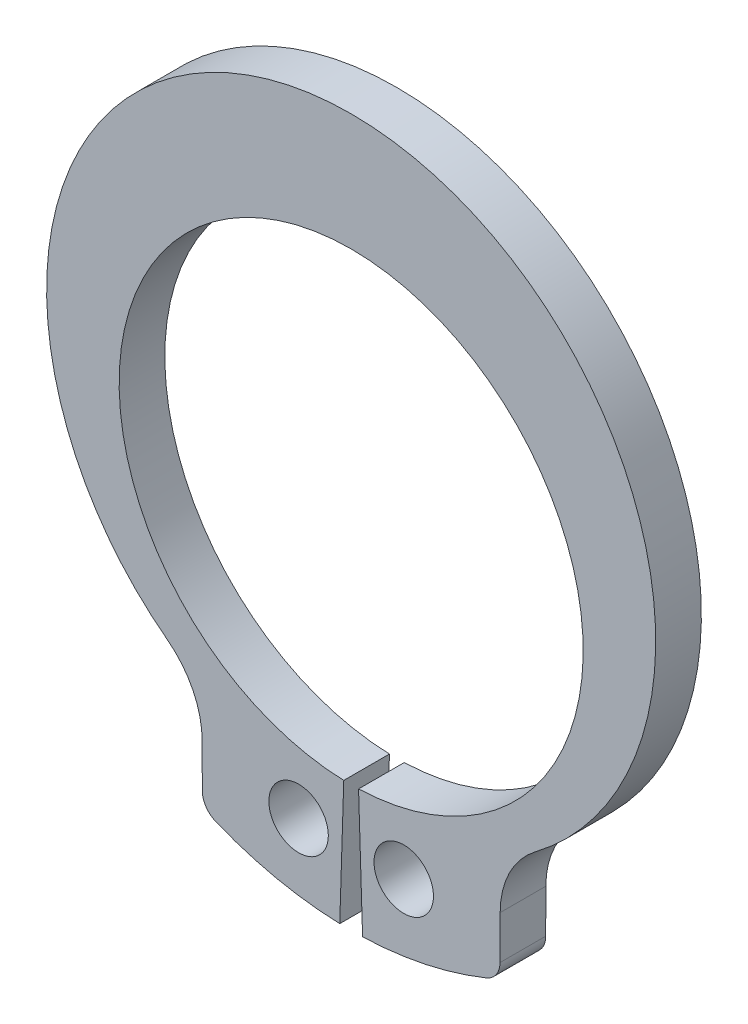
ISO-10303-21;
HEADER;
FILE_DESCRIPTION(('STEP AP214'),'2;1');
FILE_NAME('part.step','',(''),(''),'','','');
FILE_SCHEMA(('AUTOMOTIVE_DESIGN { 1 0 10303 214 1 1 1 1 }'));
ENDSEC;
DATA;
#1=APPLICATION_CONTEXT('core data for automotive mechanical design processes');
#2=APPLICATION_PROTOCOL_DEFINITION('international standard','automotive_design',2000,#1);
#3=PRODUCT_CONTEXT('',#1,'mechanical');
#4=PRODUCT('Part','Part','',(#3));
#5=PRODUCT_RELATED_PRODUCT_CATEGORY('part','',(#4));
#6=PRODUCT_DEFINITION_FORMATION('','',#4);
#7=PRODUCT_DEFINITION_CONTEXT('part definition',#1,'design');
#8=PRODUCT_DEFINITION('design','',#6,#7);
#9=PRODUCT_DEFINITION_SHAPE('','',#8);
#10=(LENGTH_UNIT() NAMED_UNIT(*) SI_UNIT(.MILLI.,.METRE.));
#11=(NAMED_UNIT(*) PLANE_ANGLE_UNIT() SI_UNIT($,.RADIAN.));
#12=(NAMED_UNIT(*) SI_UNIT($,.STERADIAN.) SOLID_ANGLE_UNIT());
#13=UNCERTAINTY_MEASURE_WITH_UNIT(LENGTH_MEASURE(1.E-05),#10,'distance_accuracy_value','');
#14=(GEOMETRIC_REPRESENTATION_CONTEXT(3) GLOBAL_UNCERTAINTY_ASSIGNED_CONTEXT((#13)) GLOBAL_UNIT_ASSIGNED_CONTEXT((#10,
#11,#12)) REPRESENTATION_CONTEXT('',''));
#15=CARTESIAN_POINT('',(0.,0.,0.));
#16=DIRECTION('',(0.,0.,1.));
#17=DIRECTION('',(1.,0.,0.));
#18=AXIS2_PLACEMENT_3D('',#15,#16,#17);
#19=CARTESIAN_POINT('',(0.,0.,-0.799999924));
#20=DIRECTION('',(0.,0.,1.));
#21=DIRECTION('',(1.,0.,0.));
#22=AXIS2_PLACEMENT_3D('',#19,#20,#21);
#23=CYLINDRICAL_SURFACE('',#22,4.064);
#24=CARTESIAN_POINT('',(0.,0.,0.));
#25=DIRECTION('',(0.,0.,-1.));
#26=DIRECTION('',(1.,0.,0.));
#27=AXIS2_PLACEMENT_3D('',#24,#25,#26);
#28=CIRCLE('',#27,4.064);
#29=CARTESIAN_POINT('',(-0.129554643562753,-4.06193446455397,0.));
#30=VERTEX_POINT('',#29);
#31=CARTESIAN_POINT('',(0.129554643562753,-4.06193446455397,0.));
#32=VERTEX_POINT('',#31);
#33=EDGE_CURVE('E153',#30,#32,#28,.T.);
#34=ORIENTED_EDGE('',*,*,#33,.F.);
#35=DIRECTION('',(0.,0.,1.));
#36=VECTOR('',#35,1.);
#37=CARTESIAN_POINT('',(-0.129554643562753,-4.06193446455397,-0.799999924));
#38=LINE('',#37,#36);
#39=CARTESIAN_POINT('',(-0.129554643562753,-4.06193446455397,-0.799999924));
#40=VERTEX_POINT('',#39);
#41=EDGE_CURVE('E11',#40,#30,#38,.T.);
#42=ORIENTED_EDGE('',*,*,#41,.F.);
#43=CARTESIAN_POINT('',(0.,0.,-0.799999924));
#44=DIRECTION('',(0.,0.,-1.));
#45=DIRECTION('',(1.,0.,0.));
#46=AXIS2_PLACEMENT_3D('',#43,#44,#45);
#47=CIRCLE('',#46,4.064);
#48=CARTESIAN_POINT('',(0.129554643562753,-4.06193446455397,-0.799999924));
#49=VERTEX_POINT('',#48);
#50=EDGE_CURVE('E186',#40,#49,#47,.T.);
#51=ORIENTED_EDGE('',*,*,#50,.T.);
#52=DIRECTION('',(0.,0.,1.));
#53=VECTOR('',#52,1.);
#54=CARTESIAN_POINT('',(0.129554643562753,-4.06193446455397,-0.799999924));
#55=LINE('',#54,#53);
#56=EDGE_CURVE('E35',#49,#32,#55,.T.);
#57=ORIENTED_EDGE('',*,*,#56,.T.);
#58=EDGE_LOOP('',(#34,#42,#51,#57));
#59=FACE_BOUND('',#58,.T.);
#60=ADVANCED_FACE('F32',(#59),#23,.F.);
#61=CARTESIAN_POINT('',(-0.129554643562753,-4.06193446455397,-0.799999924));
#62=DIRECTION('',(0.999491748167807,-0.0318786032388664,0.));
#63=DIRECTION('',(0.0318786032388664,0.999491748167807,0.));
#64=AXIS2_PLACEMENT_3D('',#61,#62,#63);
#65=PLANE('',#64);
#66=DIRECTION('',(0.0318786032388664,0.999491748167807,0.));
#67=VECTOR('',#66,1.);
#68=CARTESIAN_POINT('',(-0.129554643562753,-4.06193446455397,0.));
#69=LINE('',#68,#67);
#70=CARTESIAN_POINT('',(-0.199999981,-6.27061132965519,0.));
#71=VERTEX_POINT('',#70);
#72=EDGE_CURVE('E184',#71,#30,#69,.T.);
#73=ORIENTED_EDGE('',*,*,#72,.F.);
#74=DIRECTION('',(0.,0.,1.));
#75=VECTOR('',#74,1.);
#76=CARTESIAN_POINT('',(-0.199999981,-6.27061132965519,-0.799999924));
#77=LINE('',#76,#75);
#78=CARTESIAN_POINT('',(-0.199999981,-6.27061132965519,-0.799999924));
#79=VERTEX_POINT('',#78);
#80=EDGE_CURVE('E41',#79,#71,#77,.T.);
#81=ORIENTED_EDGE('',*,*,#80,.F.);
#82=DIRECTION('',(0.0318786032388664,0.999491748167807,0.));
#83=VECTOR('',#82,1.);
#84=CARTESIAN_POINT('',(-0.129554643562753,-4.06193446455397,-0.799999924));
#85=LINE('',#84,#83);
#86=EDGE_CURVE('E143',#79,#40,#85,.T.);
#87=ORIENTED_EDGE('',*,*,#86,.T.);
#88=ORIENTED_EDGE('',*,*,#41,.T.);
#89=EDGE_LOOP('',(#73,#81,#87,#88));
#90=FACE_BOUND('',#89,.T.);
#91=ADVANCED_FACE('F206',(#90),#65,.T.);
#92=CARTESIAN_POINT('',(0.,0.,-0.799999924));
#93=DIRECTION('',(0.,0.,1.));
#94=DIRECTION('',(1.,0.,0.));
#95=AXIS2_PLACEMENT_3D('',#92,#93,#94);
#96=CYLINDRICAL_SURFACE('',#95,6.2738);
#97=CARTESIAN_POINT('',(0.,0.,0.));
#98=DIRECTION('',(0.,0.,1.));
#99=DIRECTION('',(1.,0.,0.));
#100=AXIS2_PLACEMENT_3D('',#97,#98,#99);
#101=CIRCLE('',#100,6.2738);
#102=CARTESIAN_POINT('',(-2.37042236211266,-5.80875754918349,0.));
#103=VERTEX_POINT('',#102);
#104=EDGE_CURVE('E130',#103,#71,#101,.T.);
#105=ORIENTED_EDGE('',*,*,#104,.F.);
#106=DIRECTION('',(0.,0.,1.));
#107=VECTOR('',#106,1.);
#108=CARTESIAN_POINT('',(-2.37042236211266,-5.80875754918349,-0.799999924));
#109=LINE('',#108,#107);
#110=CARTESIAN_POINT('',(-2.37042236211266,-5.80875754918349,-0.799999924));
#111=VERTEX_POINT('',#110);
#112=EDGE_CURVE('E125',#111,#103,#109,.T.);
#113=ORIENTED_EDGE('',*,*,#112,.F.);
#114=CARTESIAN_POINT('',(0.,0.,-0.799999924));
#115=DIRECTION('',(0.,0.,1.));
#116=DIRECTION('',(1.,0.,0.));
#117=AXIS2_PLACEMENT_3D('',#114,#115,#116);
#118=CIRCLE('',#117,6.2738);
#119=EDGE_CURVE('E128',#111,#79,#118,.T.);
#120=ORIENTED_EDGE('',*,*,#119,.T.);
#121=ORIENTED_EDGE('',*,*,#80,.T.);
#122=EDGE_LOOP('',(#105,#113,#120,#121));
#123=FACE_BOUND('',#122,.T.);
#124=ADVANCED_FACE('F127',(#123),#96,.T.);
#125=CARTESIAN_POINT('',(-2.22646958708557,-5.45599899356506,-0.799999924));
#126=DIRECTION('',(0.,0.,1.));
#127=DIRECTION('',(1.,0.,0.));
#128=AXIS2_PLACEMENT_3D('',#125,#126,#127);
#129=CYLINDRICAL_SURFACE('',#128,0.381);
#130=CARTESIAN_POINT('',(-2.22646958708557,-5.45599899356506,0.));
#131=DIRECTION('',(0.,0.,1.));
#132=DIRECTION('',(1.,0.,0.));
#133=AXIS2_PLACEMENT_3D('',#130,#131,#132);
#134=CIRCLE('',#133,0.381);
#135=CARTESIAN_POINT('',(-2.60746810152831,-5.45706294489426,0.));
#136=VERTEX_POINT('',#135);
#137=EDGE_CURVE('E181',#136,#103,#134,.T.);
#138=ORIENTED_EDGE('',*,*,#137,.F.);
#139=DIRECTION('',(0.,0.,1.));
#140=VECTOR('',#139,1.);
#141=CARTESIAN_POINT('',(-2.60746810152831,-5.45706294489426,-0.799999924));
#142=LINE('',#141,#140);
#143=CARTESIAN_POINT('',(-2.60746810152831,-5.45706294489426,-0.799999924));
#144=VERTEX_POINT('',#143);
#145=EDGE_CURVE('E135',#144,#136,#142,.T.);
#146=ORIENTED_EDGE('',*,*,#145,.F.);
#147=CARTESIAN_POINT('',(-2.22646958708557,-5.45599899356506,-0.799999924));
#148=DIRECTION('',(0.,0.,1.));
#149=DIRECTION('',(1.,0.,0.));
#150=AXIS2_PLACEMENT_3D('',#147,#148,#149);
#151=CIRCLE('',#150,0.381);
#152=EDGE_CURVE('E141',#144,#111,#151,.T.);
#153=ORIENTED_EDGE('',*,*,#152,.T.);
#154=ORIENTED_EDGE('',*,*,#112,.T.);
#155=EDGE_LOOP('',(#138,#146,#153,#154));
#156=FACE_BOUND('',#155,.T.);
#157=ADVANCED_FACE('F145',(#156),#129,.T.);
#158=CARTESIAN_POINT('',(-2.60958822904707,-4.69785017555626,-0.799999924));
#159=DIRECTION('',(-0.99999610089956,-0.00279252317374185,0.));
#160=DIRECTION('',(0.00279252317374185,-0.999996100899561,0.));
#161=AXIS2_PLACEMENT_3D('',#158,#159,#160);
#162=PLANE('',#161);
#163=DIRECTION('',(0.00279252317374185,-0.99999610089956,0.));
#164=VECTOR('',#163,1.);
#165=CARTESIAN_POINT('',(-2.60958822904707,-4.69785017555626,0.));
#166=LINE('',#165,#164);
#167=CARTESIAN_POINT('',(-2.60958822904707,-4.69785017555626,0.));
#168=VERTEX_POINT('',#167);
#169=EDGE_CURVE('E178',#168,#136,#166,.T.);
#170=ORIENTED_EDGE('',*,*,#169,.F.);
#171=DIRECTION('',(0.,0.,1.));
#172=VECTOR('',#171,1.);
#173=CARTESIAN_POINT('',(-2.60958822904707,-4.69785017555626,-0.799999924));
#174=LINE('',#173,#172);
#175=CARTESIAN_POINT('',(-2.60958822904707,-4.69785017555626,-0.799999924));
#176=VERTEX_POINT('',#175);
#177=EDGE_CURVE('E190',#176,#168,#174,.T.);
#178=ORIENTED_EDGE('',*,*,#177,.F.);
#179=DIRECTION('',(0.00279252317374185,-0.99999610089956,0.));
#180=VECTOR('',#179,1.);
#181=CARTESIAN_POINT('',(-2.60958822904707,-4.69785017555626,-0.799999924));
#182=LINE('',#181,#180);
#183=EDGE_CURVE('E146',#176,#144,#182,.T.);
#184=ORIENTED_EDGE('',*,*,#183,.T.);
#185=ORIENTED_EDGE('',*,*,#145,.T.);
#186=EDGE_LOOP('',(#170,#178,#184,#185));
#187=FACE_BOUND('',#186,.T.);
#188=ADVANCED_FACE('F219',(#187),#162,.T.);
#189=CARTESIAN_POINT('',(-4.15334165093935,-4.7021611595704,-0.799999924));
#190=DIRECTION('',(0.,0.,1.));
#191=DIRECTION('',(1.,0.,0.));
#192=AXIS2_PLACEMENT_3D('',#189,#190,#191);
#193=CYLINDRICAL_SURFACE('',#192,1.54375944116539);
#194=CARTESIAN_POINT('',(-4.15334165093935,-4.7021611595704,0.));
#195=DIRECTION('',(0.,0.,-1.));
#196=DIRECTION('',(1.,0.,0.));
#197=AXIS2_PLACEMENT_3D('',#194,#195,#196);
#198=CIRCLE('',#197,1.54375944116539);
#199=CARTESIAN_POINT('',(-3.2210961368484,-3.47166877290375,0.));
#200=VERTEX_POINT('',#199);
#201=EDGE_CURVE('E175',#200,#168,#198,.T.);
#202=ORIENTED_EDGE('',*,*,#201,.F.);
#203=DIRECTION('',(0.,0.,1.));
#204=VECTOR('',#203,1.);
#205=CARTESIAN_POINT('',(-3.2210961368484,-3.47166877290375,-0.799999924));
#206=LINE('',#205,#204);
#207=CARTESIAN_POINT('',(-3.2210961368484,-3.47166877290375,-0.799999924));
#208=VERTEX_POINT('',#207);
#209=EDGE_CURVE('E192',#208,#200,#206,.T.);
#210=ORIENTED_EDGE('',*,*,#209,.F.);
#211=CARTESIAN_POINT('',(-4.15334165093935,-4.7021611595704,-0.799999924));
#212=DIRECTION('',(0.,0.,-1.));
#213=DIRECTION('',(1.,0.,0.));
#214=AXIS2_PLACEMENT_3D('',#211,#212,#213);
#215=CIRCLE('',#214,1.54375944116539);
#216=EDGE_CURVE('E148',#208,#176,#215,.T.);
#217=ORIENTED_EDGE('',*,*,#216,.T.);
#218=ORIENTED_EDGE('',*,*,#177,.T.);
#219=EDGE_LOOP('',(#202,#210,#217,#218));
#220=FACE_BOUND('',#219,.T.);
#221=ADVANCED_FACE('F222',(#220),#193,.F.);
#222=CARTESIAN_POINT('',(0.,0.77993041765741,-0.799999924));
#223=DIRECTION('',(0.,0.,1.));
#224=DIRECTION('',(1.,0.,0.));
#225=AXIS2_PLACEMENT_3D('',#222,#223,#224);
#226=CYLINDRICAL_SURFACE('',#225,5.334);
#227=CARTESIAN_POINT('',(0.,0.77993041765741,0.));
#228=DIRECTION('',(0.,0.,1.));
#229=DIRECTION('',(1.,0.,0.));
#230=AXIS2_PLACEMENT_3D('',#227,#228,#229);
#231=CIRCLE('',#230,5.334);
#232=CARTESIAN_POINT('',(3.2210961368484,-3.47166877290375,0.));
#233=VERTEX_POINT('',#232);
#234=EDGE_CURVE('E172',#233,#200,#231,.T.);
#235=ORIENTED_EDGE('',*,*,#234,.F.);
#236=DIRECTION('',(0.,0.,1.));
#237=VECTOR('',#236,1.);
#238=CARTESIAN_POINT('',(3.2210961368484,-3.47166877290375,-0.799999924));
#239=LINE('',#238,#237);
#240=CARTESIAN_POINT('',(3.2210961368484,-3.47166877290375,-0.799999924));
#241=VERTEX_POINT('',#240);
#242=EDGE_CURVE('E194',#241,#233,#239,.T.);
#243=ORIENTED_EDGE('',*,*,#242,.F.);
#244=CARTESIAN_POINT('',(0.,0.77993041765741,-0.799999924));
#245=DIRECTION('',(0.,0.,1.));
#246=DIRECTION('',(1.,0.,0.));
#247=AXIS2_PLACEMENT_3D('',#244,#245,#246);
#248=CIRCLE('',#247,5.334);
#249=EDGE_CURVE('E296',#241,#208,#248,.T.);
#250=ORIENTED_EDGE('',*,*,#249,.T.);
#251=ORIENTED_EDGE('',*,*,#209,.T.);
#252=EDGE_LOOP('',(#235,#243,#250,#251));
#253=FACE_BOUND('',#252,.T.);
#254=ADVANCED_FACE('F226',(#253),#226,.T.);
#255=CARTESIAN_POINT('',(4.15334165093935,-4.7021611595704,-0.799999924));
#256=DIRECTION('',(0.,0.,1.));
#257=DIRECTION('',(1.,0.,0.));
#258=AXIS2_PLACEMENT_3D('',#255,#256,#257);
#259=CYLINDRICAL_SURFACE('',#258,1.54375944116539);
#260=CARTESIAN_POINT('',(4.15334165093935,-4.7021611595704,0.));
#261=DIRECTION('',(0.,0.,-1.));
#262=DIRECTION('',(1.,0.,0.));
#263=AXIS2_PLACEMENT_3D('',#260,#261,#262);
#264=CIRCLE('',#263,1.54375944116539);
#265=CARTESIAN_POINT('',(2.60958822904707,-4.69785017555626,0.));
#266=VERTEX_POINT('',#265);
#267=EDGE_CURVE('E169',#266,#233,#264,.T.);
#268=ORIENTED_EDGE('',*,*,#267,.F.);
#269=DIRECTION('',(0.,0.,1.));
#270=VECTOR('',#269,1.);
#271=CARTESIAN_POINT('',(2.60958822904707,-4.69785017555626,-0.799999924));
#272=LINE('',#271,#270);
#273=CARTESIAN_POINT('',(2.60958822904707,-4.69785017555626,-0.799999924));
#274=VERTEX_POINT('',#273);
#275=EDGE_CURVE('E196',#274,#266,#272,.T.);
#276=ORIENTED_EDGE('',*,*,#275,.F.);
#277=CARTESIAN_POINT('',(4.15334165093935,-4.7021611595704,-0.799999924));
#278=DIRECTION('',(0.,0.,-1.));
#279=DIRECTION('',(1.,0.,0.));
#280=AXIS2_PLACEMENT_3D('',#277,#278,#279);
#281=CIRCLE('',#280,1.54375944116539);
#282=EDGE_CURVE('E293',#274,#241,#281,.T.);
#283=ORIENTED_EDGE('',*,*,#282,.T.);
#284=ORIENTED_EDGE('',*,*,#242,.T.);
#285=EDGE_LOOP('',(#268,#276,#283,#284));
#286=FACE_BOUND('',#285,.T.);
#287=ADVANCED_FACE('F230',(#286),#259,.F.);
#288=CARTESIAN_POINT('',(2.60958822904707,-4.69785017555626,-0.799999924));
#289=DIRECTION('',(0.99999610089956,-0.00279252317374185,0.));
#290=DIRECTION('',(0.00279252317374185,0.999996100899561,0.));
#291=AXIS2_PLACEMENT_3D('',#288,#289,#290);
#292=PLANE('',#291);
#293=DIRECTION('',(0.00279252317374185,0.99999610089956,0.));
#294=VECTOR('',#293,1.);
#295=CARTESIAN_POINT('',(2.60958822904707,-4.69785017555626,0.));
#296=LINE('',#295,#294);
#297=CARTESIAN_POINT('',(2.60746810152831,-5.45706294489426,0.));
#298=VERTEX_POINT('',#297);
#299=EDGE_CURVE('E166',#298,#266,#296,.T.);
#300=ORIENTED_EDGE('',*,*,#299,.F.);
#301=DIRECTION('',(0.,0.,1.));
#302=VECTOR('',#301,1.);
#303=CARTESIAN_POINT('',(2.60746810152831,-5.45706294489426,-0.799999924));
#304=LINE('',#303,#302);
#305=CARTESIAN_POINT('',(2.60746810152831,-5.45706294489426,-0.799999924));
#306=VERTEX_POINT('',#305);
#307=EDGE_CURVE('E198',#306,#298,#304,.T.);
#308=ORIENTED_EDGE('',*,*,#307,.F.);
#309=DIRECTION('',(0.00279252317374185,0.99999610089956,0.));
#310=VECTOR('',#309,1.);
#311=CARTESIAN_POINT('',(2.60958822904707,-4.69785017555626,-0.799999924));
#312=LINE('',#311,#310);
#313=EDGE_CURVE('E290',#306,#274,#312,.T.);
#314=ORIENTED_EDGE('',*,*,#313,.T.);
#315=ORIENTED_EDGE('',*,*,#275,.T.);
#316=EDGE_LOOP('',(#300,#308,#314,#315));
#317=FACE_BOUND('',#316,.T.);
#318=ADVANCED_FACE('F234',(#317),#292,.T.);
#319=CARTESIAN_POINT('',(2.22646958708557,-5.45599899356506,-0.799999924));
#320=DIRECTION('',(0.,0.,1.));
#321=DIRECTION('',(1.,0.,0.));
#322=AXIS2_PLACEMENT_3D('',#319,#320,#321);
#323=CYLINDRICAL_SURFACE('',#322,0.381);
#324=CARTESIAN_POINT('',(2.22646958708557,-5.45599899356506,0.));
#325=DIRECTION('',(0.,0.,1.));
#326=DIRECTION('',(-1.,0.,0.));
#327=AXIS2_PLACEMENT_3D('',#324,#325,#326);
#328=CIRCLE('',#327,0.381);
#329=CARTESIAN_POINT('',(2.37042236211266,-5.8087575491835,0.));
#330=VERTEX_POINT('',#329);
#331=EDGE_CURVE('E163',#330,#298,#328,.T.);
#332=ORIENTED_EDGE('',*,*,#331,.F.);
#333=DIRECTION('',(0.,0.,1.));
#334=VECTOR('',#333,1.);
#335=CARTESIAN_POINT('',(2.37042236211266,-5.8087575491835,-0.799999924));
#336=LINE('',#335,#334);
#337=CARTESIAN_POINT('',(2.37042236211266,-5.8087575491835,-0.799999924));
#338=VERTEX_POINT('',#337);
#339=EDGE_CURVE('E200',#338,#330,#336,.T.);
#340=ORIENTED_EDGE('',*,*,#339,.F.);
#341=CARTESIAN_POINT('',(2.22646958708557,-5.45599899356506,-0.799999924));
#342=DIRECTION('',(0.,0.,1.));
#343=DIRECTION('',(-1.,0.,0.));
#344=AXIS2_PLACEMENT_3D('',#341,#342,#343);
#345=CIRCLE('',#344,0.381);
#346=EDGE_CURVE('E287',#338,#306,#345,.T.);
#347=ORIENTED_EDGE('',*,*,#346,.T.);
#348=ORIENTED_EDGE('',*,*,#307,.T.);
#349=EDGE_LOOP('',(#332,#340,#347,#348));
#350=FACE_BOUND('',#349,.T.);
#351=ADVANCED_FACE('F238',(#350),#323,.T.);
#352=CARTESIAN_POINT('',(0.,0.,-0.799999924));
#353=DIRECTION('',(0.,0.,1.));
#354=DIRECTION('',(1.,0.,0.));
#355=AXIS2_PLACEMENT_3D('',#352,#353,#354);
#356=CYLINDRICAL_SURFACE('',#355,6.2738);
#357=CARTESIAN_POINT('',(0.,0.,0.));
#358=DIRECTION('',(0.,0.,1.));
#359=DIRECTION('',(1.,0.,0.));
#360=AXIS2_PLACEMENT_3D('',#357,#358,#359);
#361=CIRCLE('',#360,6.2738);
#362=CARTESIAN_POINT('',(0.199999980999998,-6.27061132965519,0.));
#363=VERTEX_POINT('',#362);
#364=EDGE_CURVE('E160',#363,#330,#361,.T.);
#365=ORIENTED_EDGE('',*,*,#364,.F.);
#366=DIRECTION('',(0.,0.,1.));
#367=VECTOR('',#366,1.);
#368=CARTESIAN_POINT('',(0.199999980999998,-6.27061132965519,-0.799999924));
#369=LINE('',#368,#367);
#370=CARTESIAN_POINT('',(0.199999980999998,-6.27061132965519,-0.799999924));
#371=VERTEX_POINT('',#370);
#372=EDGE_CURVE('E201',#371,#363,#369,.T.);
#373=ORIENTED_EDGE('',*,*,#372,.F.);
#374=CARTESIAN_POINT('',(0.,0.,-0.799999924));
#375=DIRECTION('',(0.,0.,1.));
#376=DIRECTION('',(1.,0.,0.));
#377=AXIS2_PLACEMENT_3D('',#374,#375,#376);
#378=CIRCLE('',#377,6.2738);
#379=EDGE_CURVE('E284',#371,#338,#378,.T.);
#380=ORIENTED_EDGE('',*,*,#379,.T.);
#381=ORIENTED_EDGE('',*,*,#339,.T.);
#382=EDGE_LOOP('',(#365,#373,#380,#381));
#383=FACE_BOUND('',#382,.T.);
#384=ADVANCED_FACE('F242',(#383),#356,.T.);
#385=CARTESIAN_POINT('',(0.129554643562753,-4.06193446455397,-0.799999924));
#386=DIRECTION('',(-0.999491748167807,-0.0318786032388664,0.));
#387=DIRECTION('',(0.0318786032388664,-0.999491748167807,0.));
#388=AXIS2_PLACEMENT_3D('',#385,#386,#387);
#389=PLANE('',#388);
#390=DIRECTION('',(0.0318786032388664,-0.999491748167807,0.));
#391=VECTOR('',#390,1.);
#392=CARTESIAN_POINT('',(0.129554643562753,-4.06193446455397,0.));
#393=LINE('',#392,#391);
#394=EDGE_CURVE('E156',#32,#363,#393,.T.);
#395=ORIENTED_EDGE('',*,*,#394,.F.);
#396=ORIENTED_EDGE('',*,*,#56,.F.);
#397=DIRECTION('',(0.0318786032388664,-0.999491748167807,0.));
#398=VECTOR('',#397,1.);
#399=CARTESIAN_POINT('',(0.129554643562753,-4.06193446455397,-0.799999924));
#400=LINE('',#399,#398);
#401=EDGE_CURVE('E282',#49,#371,#400,.T.);
#402=ORIENTED_EDGE('',*,*,#401,.T.);
#403=ORIENTED_EDGE('',*,*,#372,.T.);
#404=EDGE_LOOP('',(#395,#396,#402,#403));
#405=FACE_BOUND('',#404,.T.);
#406=ADVANCED_FACE('F203',(#405),#389,.T.);
#407=CARTESIAN_POINT('',(0.,0.,-0.799999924));
#408=DIRECTION('',(0.,0.,1.));
#409=DIRECTION('',(1.,0.,0.));
#410=AXIS2_PLACEMENT_3D('',#407,#408,#409);
#411=PLANE('',#410);
#412=CARTESIAN_POINT('',(-0.920699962,-5.03460616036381,-0.799999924));
#413=DIRECTION('',(0.,0.,1.));
#414=DIRECTION('',(1.,0.,0.));
#415=AXIS2_PLACEMENT_3D('',#412,#413,#414);
#416=CIRCLE('',#415,0.5207);
#417=CARTESIAN_POINT('',(-0.399999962,-5.03460616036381,-0.799999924));
#418=VERTEX_POINT('',#417);
#419=EDGE_CURVE('E269',#418,#418,#416,.T.);
#420=ORIENTED_EDGE('',*,*,#419,.T.);
#421=EDGE_LOOP('',(#420));
#422=FACE_BOUND('',#421,.T.);
#423=CARTESIAN_POINT('',(0.920699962,-5.03460616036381,-0.799999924));
#424=DIRECTION('',(0.,0.,1.));
#425=DIRECTION('',(1.,0.,0.));
#426=AXIS2_PLACEMENT_3D('',#423,#424,#425);
#427=CIRCLE('',#426,0.5207);
#428=CARTESIAN_POINT('',(1.441399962,-5.03460616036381,-0.799999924));
#429=VERTEX_POINT('',#428);
#430=EDGE_CURVE('E157',#429,#429,#427,.T.);
#431=ORIENTED_EDGE('',*,*,#430,.T.);
#432=EDGE_LOOP('',(#431));
#433=FACE_BOUND('',#432,.T.);
#434=ORIENTED_EDGE('',*,*,#50,.F.);
#435=ORIENTED_EDGE('',*,*,#86,.F.);
#436=ORIENTED_EDGE('',*,*,#119,.F.);
#437=ORIENTED_EDGE('',*,*,#152,.F.);
#438=ORIENTED_EDGE('',*,*,#183,.F.);
#439=ORIENTED_EDGE('',*,*,#216,.F.);
#440=ORIENTED_EDGE('',*,*,#249,.F.);
#441=ORIENTED_EDGE('',*,*,#282,.F.);
#442=ORIENTED_EDGE('',*,*,#313,.F.);
#443=ORIENTED_EDGE('',*,*,#346,.F.);
#444=ORIENTED_EDGE('',*,*,#379,.F.);
#445=ORIENTED_EDGE('',*,*,#401,.F.);
#446=EDGE_LOOP('',(#434,#435,#436,#437,#438,#439,#440,#441,#442,#443,#444,#445));
#447=FACE_BOUND('',#446,.T.);
#448=ADVANCED_FACE('F139',(#422,#433,#447),#411,.F.);
#449=CARTESIAN_POINT('',(0.,0.,0.));
#450=DIRECTION('',(0.,0.,1.));
#451=DIRECTION('',(1.,0.,0.));
#452=AXIS2_PLACEMENT_3D('',#449,#450,#451);
#453=PLANE('',#452);
#454=CARTESIAN_POINT('',(-0.920699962,-5.03460616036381,0.));
#455=DIRECTION('',(0.,0.,1.));
#456=DIRECTION('',(1.,0.,0.));
#457=AXIS2_PLACEMENT_3D('',#454,#455,#456);
#458=CIRCLE('',#457,0.5207);
#459=CARTESIAN_POINT('',(-0.399999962,-5.03460616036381,0.));
#460=VERTEX_POINT('',#459);
#461=EDGE_CURVE('E272',#460,#460,#458,.T.);
#462=ORIENTED_EDGE('',*,*,#461,.F.);
#463=EDGE_LOOP('',(#462));
#464=FACE_BOUND('',#463,.T.);
#465=CARTESIAN_POINT('',(0.920699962,-5.03460616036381,0.));
#466=DIRECTION('',(0.,0.,1.));
#467=DIRECTION('',(1.,0.,0.));
#468=AXIS2_PLACEMENT_3D('',#465,#466,#467);
#469=CIRCLE('',#468,0.5207);
#470=CARTESIAN_POINT('',(1.441399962,-5.03460616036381,0.));
#471=VERTEX_POINT('',#470);
#472=EDGE_CURVE('E274',#471,#471,#469,.T.);
#473=ORIENTED_EDGE('',*,*,#472,.F.);
#474=EDGE_LOOP('',(#473));
#475=FACE_BOUND('',#474,.T.);
#476=ORIENTED_EDGE('',*,*,#33,.T.);
#477=ORIENTED_EDGE('',*,*,#394,.T.);
#478=ORIENTED_EDGE('',*,*,#364,.T.);
#479=ORIENTED_EDGE('',*,*,#331,.T.);
#480=ORIENTED_EDGE('',*,*,#299,.T.);
#481=ORIENTED_EDGE('',*,*,#267,.T.);
#482=ORIENTED_EDGE('',*,*,#234,.T.);
#483=ORIENTED_EDGE('',*,*,#201,.T.);
#484=ORIENTED_EDGE('',*,*,#169,.T.);
#485=ORIENTED_EDGE('',*,*,#137,.T.);
#486=ORIENTED_EDGE('',*,*,#104,.T.);
#487=ORIENTED_EDGE('',*,*,#72,.T.);
#488=EDGE_LOOP('',(#476,#477,#478,#479,#480,#481,#482,#483,#484,#485,#486,#487));
#489=FACE_BOUND('',#488,.T.);
#490=ADVANCED_FACE('F205',(#464,#475,#489),#453,.T.);
#491=CARTESIAN_POINT('',(0.920699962,-5.03460616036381,-0.799999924));
#492=DIRECTION('',(0.,0.,1.));
#493=DIRECTION('',(1.,0.,0.));
#494=AXIS2_PLACEMENT_3D('',#491,#492,#493);
#495=CYLINDRICAL_SURFACE('',#494,0.5207);
#496=ORIENTED_EDGE('',*,*,#430,.F.);
#497=EDGE_LOOP('',(#496));
#498=FACE_BOUND('',#497,.T.);
#499=ORIENTED_EDGE('',*,*,#472,.T.);
#500=EDGE_LOOP('',(#499));
#501=FACE_BOUND('',#500,.T.);
#502=ADVANCED_FACE('F254',(#498,#501),#495,.F.);
#503=CARTESIAN_POINT('',(-0.920699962,-5.03460616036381,-0.799999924));
#504=DIRECTION('',(0.,0.,1.));
#505=DIRECTION('',(1.,0.,0.));
#506=AXIS2_PLACEMENT_3D('',#503,#504,#505);
#507=CYLINDRICAL_SURFACE('',#506,0.5207);
#508=ORIENTED_EDGE('',*,*,#419,.F.);
#509=EDGE_LOOP('',(#508));
#510=FACE_BOUND('',#509,.T.);
#511=ORIENTED_EDGE('',*,*,#461,.T.);
#512=EDGE_LOOP('',(#511));
#513=FACE_BOUND('',#512,.T.);
#514=ADVANCED_FACE('F261',(#510,#513),#507,.F.);
#515=CLOSED_SHELL('',(#60,#91,#124,#157,#188,#221,#254,#287,#318,#351,#384,#406,#448,#490,#502,#514));
#516=MANIFOLD_SOLID_BREP('B2',#515);
#517=ADVANCED_BREP_SHAPE_REPRESENTATION('',(#18,#516),#14);
#518=SHAPE_DEFINITION_REPRESENTATION(#9,#517);
ENDSEC;
END-ISO-10303-21;
